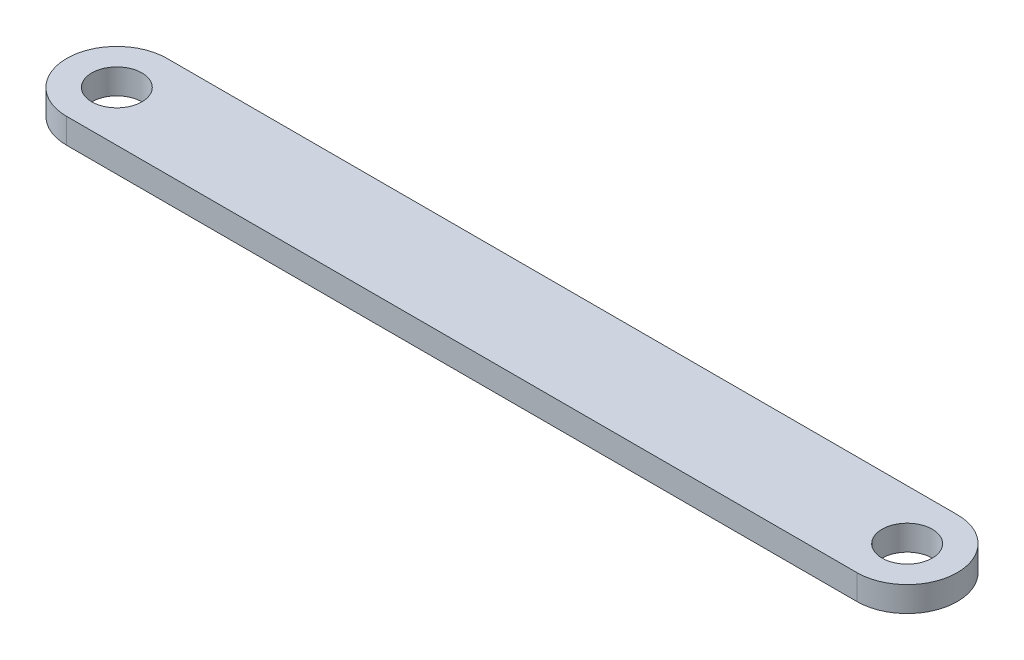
from build123d import *

# Parameters (mm, degrees)
SKETCH1_R           = 3.175
BOSS_EXTRUDE1_DEPTH = 3.175


with BuildPart() as part:
    # Sketch1 → Boss-Extrude1 (new body)
    with BuildSketch(Plane(origin=(0, 0, 0), x_dir=(1, 0, 0), z_dir=(0, 1, 0))):
        with BuildLine():
            Line((0, 6.35), (100, 6.35))
            ThreePointArc((100, 6.35), (106.35, 0), (100, -6.35))
            Line((100, -6.35), (0, -6.35))
            ThreePointArc((0, -6.35), (-6.35, 0), (0, 6.35))
        make_face()
        with Locations(Location((0, 0, 0), (0, 0, 270))):
            Circle(SKETCH1_R, mode=Mode.SUBTRACT)
        with Locations(Location((100, 0, 0), (0, 0, 270))):
            Circle(SKETCH1_R, mode=Mode.SUBTRACT)
    extrude(amount=BOSS_EXTRUDE1_DEPTH)


solid = part.part
